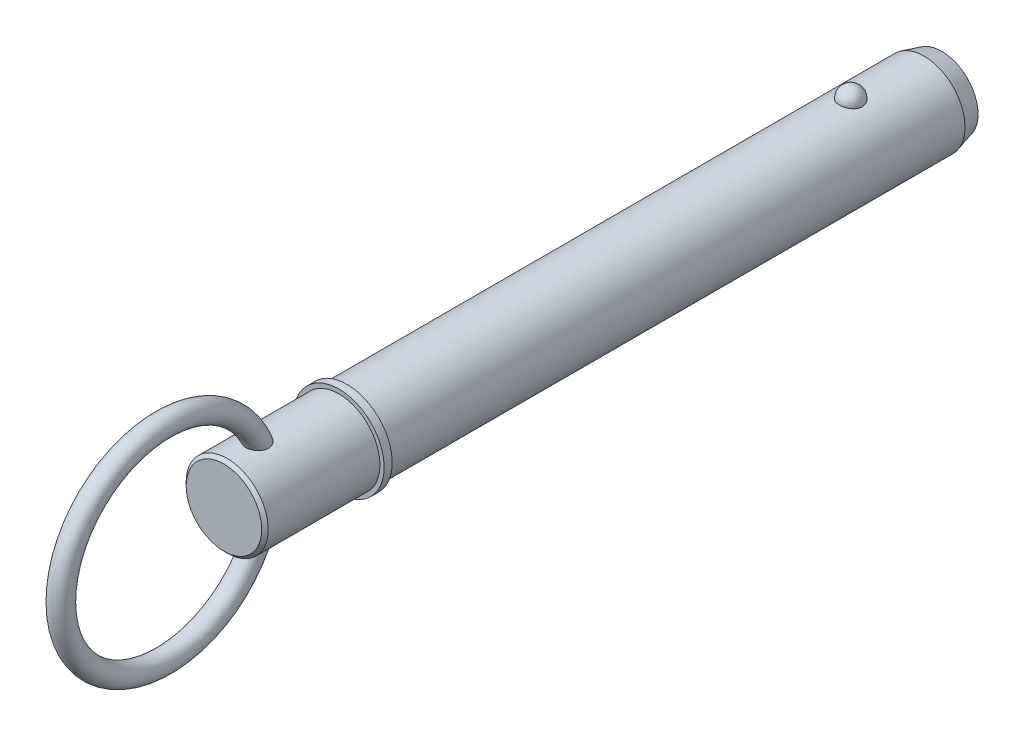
from build123d import *

# Parameters (mm, degrees)
SKETCH2_R           = 12.7
BOSS_EXTRUDE1_DEPTH = 152.4
BOSS_EXTRUDE2_START = 31.75
SKETCH3_R           = 12.7
BOSS_EXTRUDE2_DEPTH = 31.75
CHAMFER1_SIZE       = 5.5
CHAMFER1_SIZE2      = 1.473720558
SKETCH20_W          = 2.5
SKETCH20_H          = 14
SKETCH21_R          = 12.7
BOSS_EXTRUDE3_DEPTH = 38.1
CHAMFER2_SIZE       = 1
SKETCH24_R          = 3.25


with BuildPart() as part:
    # Sketch2 → Boss-Extrude1 (new body)
    with BuildSketch(Plane.XY):
        with Locations(Location((0, 0, 0), (0, 0, 180))):
            Circle(SKETCH2_R)
    extrude(amount=BOSS_EXTRUDE1_DEPTH)

    # Sketch3 → Boss-Extrude2 (add)
    with BuildSketch(Plane(origin=(0, 0, 0), x_dir=(-1, 0, 0), z_dir=(0, 0, -1)).offset(BOSS_EXTRUDE2_START)):
        Circle(SKETCH3_R)
    extrude(amount=-BOSS_EXTRUDE2_DEPTH)

    # Chamfer1
    chamfer1_edges = [part.edges().sort_by_distance(p)[0] for p in [
        (12.7, 0, -31.75),
    ]]
    chamfer1_side = [part.faces().sort_by_distance(p)[0] for p in [
        (12.7, 0, 60.325),
    ]]
    chamfer(chamfer1_edges, length=CHAMFER1_SIZE, length2=CHAMFER1_SIZE2, reference=chamfer1_side[0])

    # Sketch18 → Revolve1 (revolve)
    with BuildSketch(Plane(origin=(0, 0, 0), x_dir=(0, 0, -1), z_dir=(1, 0, 0))):
        with BuildLine():
            Line((3.56, 16.26), (3.56, 9.14))
            ThreePointArc((3.56, 9.14), (0, 12.7), (3.56, 16.26))
        make_face()
    revolve(axis=Axis((0, 16.26, -3.56), (0, -1, 0)))

    # Sketch20 → Revolve2 (revolve)
    with BuildSketch(Plane(origin=(0, 0, 0), x_dir=(0, 0, -1), z_dir=(1, 0, 0)), mode=Mode.PRIVATE) as revolve2_sk:
        with Locations((-153.65, 7)):
            Rectangle(SKETCH20_W, SKETCH20_H)
    revolve(revolve2_sk.sketch.rotate(Axis((0, 0, 33.728787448), (0, 0, 1)), 90), axis=Axis((0, 0, 33.728787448), (0, 0, 1)))

    # Sketch21 → Boss-Extrude3 (add)
    with BuildSketch(Plane(origin=(0, 0, 152.4), x_dir=(-1, 0, 0), z_dir=(0, 0, -1))):
        Circle(SKETCH21_R)
    extrude(amount=-BOSS_EXTRUDE3_DEPTH)

    # Chamfer2
    chamfer2_edges = [part.edges().sort_by_distance(p)[0] for p in [
        (12.7, 0, 190.5),
    ]]
    chamfer(chamfer2_edges, length=CHAMFER2_SIZE)

    # Sweep1: sweep along a path in Sketch23
    with BuildLine(Plane(origin=(0, 0, 0), x_dir=(0, 0, -1), z_dir=(1, 0, 0))) as sweep1_path:
        CenterArc((-209.25, 0), 31.75, 0, 360)
    # Sketch24 → Sweep1 (sweep)
    with BuildSketch(Plane(origin=(0, 0, 0), x_dir=(1, 0, 0), z_dir=(0, 1, 0))):
        with Locations((0, -177.5)):
            Circle(SKETCH24_R)
    sweep(path=sweep1_path.line)


solid = part.part
